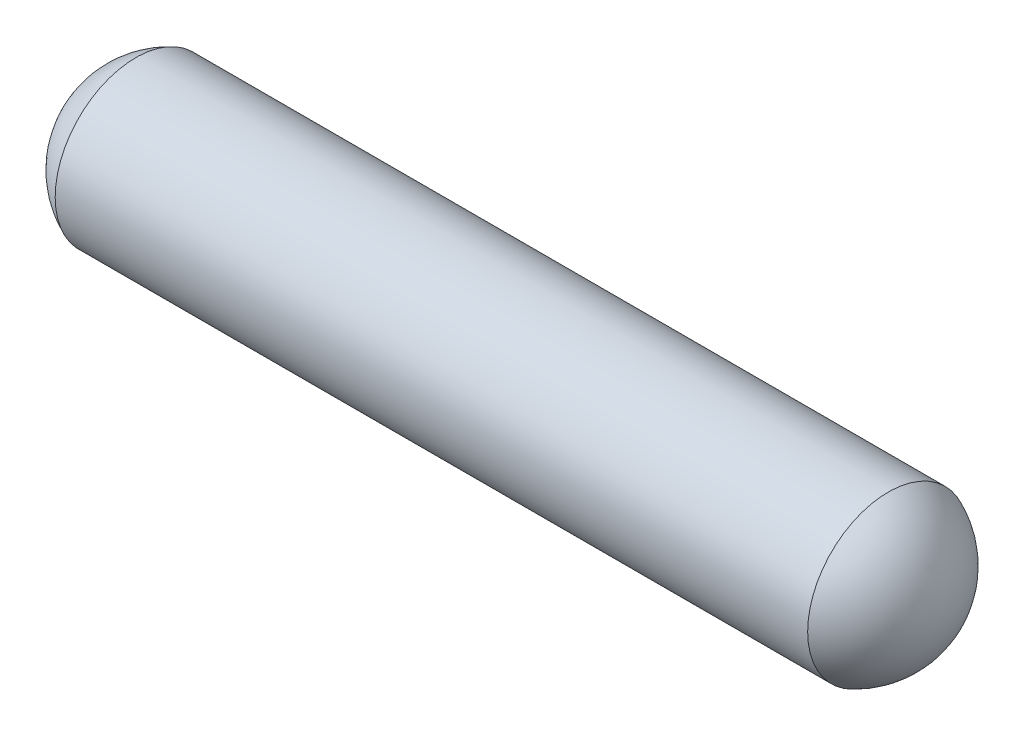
ISO-10303-21;
HEADER;
FILE_DESCRIPTION(('STEP AP214'),'2;1');
FILE_NAME('part.step','',(''),(''),'','','');
FILE_SCHEMA(('AUTOMOTIVE_DESIGN { 1 0 10303 214 1 1 1 1 }'));
ENDSEC;
DATA;
#1=APPLICATION_CONTEXT('core data for automotive mechanical design processes');
#2=APPLICATION_PROTOCOL_DEFINITION('international standard','automotive_design',2000,#1);
#3=PRODUCT_CONTEXT('',#1,'mechanical');
#4=PRODUCT('Part','Part','',(#3));
#5=PRODUCT_RELATED_PRODUCT_CATEGORY('part','',(#4));
#6=PRODUCT_DEFINITION_FORMATION('','',#4);
#7=PRODUCT_DEFINITION_CONTEXT('part definition',#1,'design');
#8=PRODUCT_DEFINITION('design','',#6,#7);
#9=PRODUCT_DEFINITION_SHAPE('','',#8);
#10=(LENGTH_UNIT() NAMED_UNIT(*) SI_UNIT(.MILLI.,.METRE.));
#11=(NAMED_UNIT(*) PLANE_ANGLE_UNIT() SI_UNIT($,.RADIAN.));
#12=(NAMED_UNIT(*) SI_UNIT($,.STERADIAN.) SOLID_ANGLE_UNIT());
#13=UNCERTAINTY_MEASURE_WITH_UNIT(LENGTH_MEASURE(1.E-05),#10,'distance_accuracy_value','');
#14=(GEOMETRIC_REPRESENTATION_CONTEXT(3) GLOBAL_UNCERTAINTY_ASSIGNED_CONTEXT((#13)) GLOBAL_UNIT_ASSIGNED_CONTEXT((#10,
#11,#12)) REPRESENTATION_CONTEXT('',''));
#15=CARTESIAN_POINT('',(0.,0.,0.));
#16=DIRECTION('',(0.,0.,1.));
#17=DIRECTION('',(1.,0.,0.));
#18=AXIS2_PLACEMENT_3D('',#15,#16,#17);
#19=CARTESIAN_POINT('',(-3.1875,0.,0.));
#20=DIRECTION('',(0.,0.,1.));
#21=DIRECTION('',(1.,0.,0.));
#22=AXIS2_PLACEMENT_3D('',#19,#20,#21);
#23=SPHERICAL_SURFACE('',#22,0.8125);
#24=CARTESIAN_POINT('',(-3.1875,0.,0.));
#25=DIRECTION('',(-1.,0.,0.));
#26=DIRECTION('',(0.,0.,1.));
#27=AXIS2_PLACEMENT_3D('',#24,#25,#26);
#28=SPHERICAL_SURFACE('',#27,0.8125);
#29=CARTESIAN_POINT('',(-3.5,0.,0.));
#30=DIRECTION('',(-1.,0.,0.));
#31=DIRECTION('',(0.,0.,1.));
#32=AXIS2_PLACEMENT_3D('',#29,#30,#31);
#33=CIRCLE('',#32,0.75);
#34=CARTESIAN_POINT('',(-3.5,0.,0.75));
#35=VERTEX_POINT('',#34);
#36=EDGE_CURVE('E10',#35,#35,#33,.T.);
#37=ORIENTED_EDGE('',*,*,#36,.T.);
#38=EDGE_LOOP('',(#37));
#39=FACE_BOUND('',#38,.T.);
#40=ADVANCED_FACE('F30',(#39),#28,.T.);
#41=CARTESIAN_POINT('',(-3.5,0.,0.));
#42=DIRECTION('',(-1.,0.,0.));
#43=DIRECTION('',(0.,0.,1.));
#44=AXIS2_PLACEMENT_3D('',#41,#42,#43);
#45=CYLINDRICAL_SURFACE('',#44,0.75);
#46=ORIENTED_EDGE('',*,*,#36,.F.);
#47=EDGE_LOOP('',(#46));
#48=FACE_BOUND('',#47,.T.);
#49=CARTESIAN_POINT('',(3.5,0.,0.));
#50=DIRECTION('',(-1.,0.,0.));
#51=DIRECTION('',(0.,0.,1.));
#52=AXIS2_PLACEMENT_3D('',#49,#50,#51);
#53=CIRCLE('',#52,0.75);
#54=CARTESIAN_POINT('',(3.5,0.,0.75));
#55=VERTEX_POINT('',#54);
#56=EDGE_CURVE('E36',#55,#55,#53,.T.);
#57=ORIENTED_EDGE('',*,*,#56,.T.);
#58=EDGE_LOOP('',(#57));
#59=FACE_BOUND('',#58,.T.);
#60=ADVANCED_FACE('F42',(#48,#59),#45,.T.);
#61=CARTESIAN_POINT('',(3.1875,0.,0.));
#62=DIRECTION('',(0.,0.,1.));
#63=DIRECTION('',(1.,0.,0.));
#64=AXIS2_PLACEMENT_3D('',#61,#62,#63);
#65=SPHERICAL_SURFACE('',#64,0.8125);
#66=CARTESIAN_POINT('',(3.1875,0.,0.));
#67=DIRECTION('',(-1.,0.,0.));
#68=DIRECTION('',(0.,0.,1.));
#69=AXIS2_PLACEMENT_3D('',#66,#67,#68);
#70=SPHERICAL_SURFACE('',#69,0.8125);
#71=ORIENTED_EDGE('',*,*,#56,.F.);
#72=EDGE_LOOP('',(#71));
#73=FACE_BOUND('',#72,.T.);
#74=ADVANCED_FACE('F44',(#73),#70,.T.);
#75=CLOSED_SHELL('',(#40,#60,#74));
#76=MANIFOLD_SOLID_BREP('B2',#75);
#77=ADVANCED_BREP_SHAPE_REPRESENTATION('',(#18,#76),#14);
#78=SHAPE_DEFINITION_REPRESENTATION(#9,#77);
ENDSEC;
END-ISO-10303-21;
